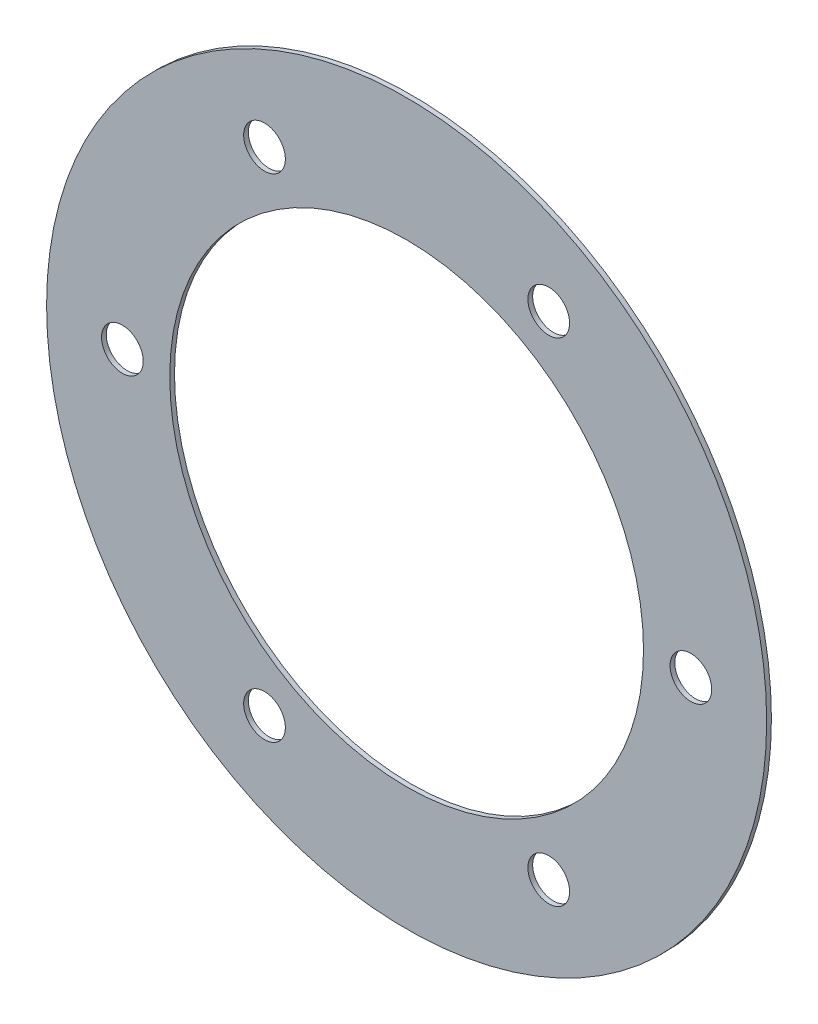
from build123d import *

# Parameters (mm, degrees)
ESQUISSE1_R                  = 38
ESQUISSE1_R_2                = 25
BASE_EXTRUSION_DEPTH         = 0.5
PASSAGE_VIS_D                = 4.4
R_P_TITION_CIRCULAIRE1_COUNT = 6


with BuildPart() as part:
    # Esquisse1 → Base-Extrusion (new body)
    with BuildSketch(Plane.XY):
        Circle(ESQUISSE1_R)
        Circle(ESQUISSE1_R_2, mode=Mode.SUBTRACT)
    extrude(amount=BASE_EXTRUSION_DEPTH)

    # Passage vis (through all)
    with Locations(Plane.XY.offset(0.5)):
        with Locations((30, 0)):
            passage_vis = Hole(PASSAGE_VIS_D / 2)

    # R_p_tition circulaire1: Passage vis ×6 about axis
    r_p_tition_circulaire1_axis = Axis((0, 0, 0), (0, 0, -1))
    for i in range(1, R_P_TITION_CIRCULAIRE1_COUNT):
        add(passage_vis.rotate(r_p_tition_circulaire1_axis, i * 360 / R_P_TITION_CIRCULAIRE1_COUNT), mode=Mode.SUBTRACT)


solid = part.part
